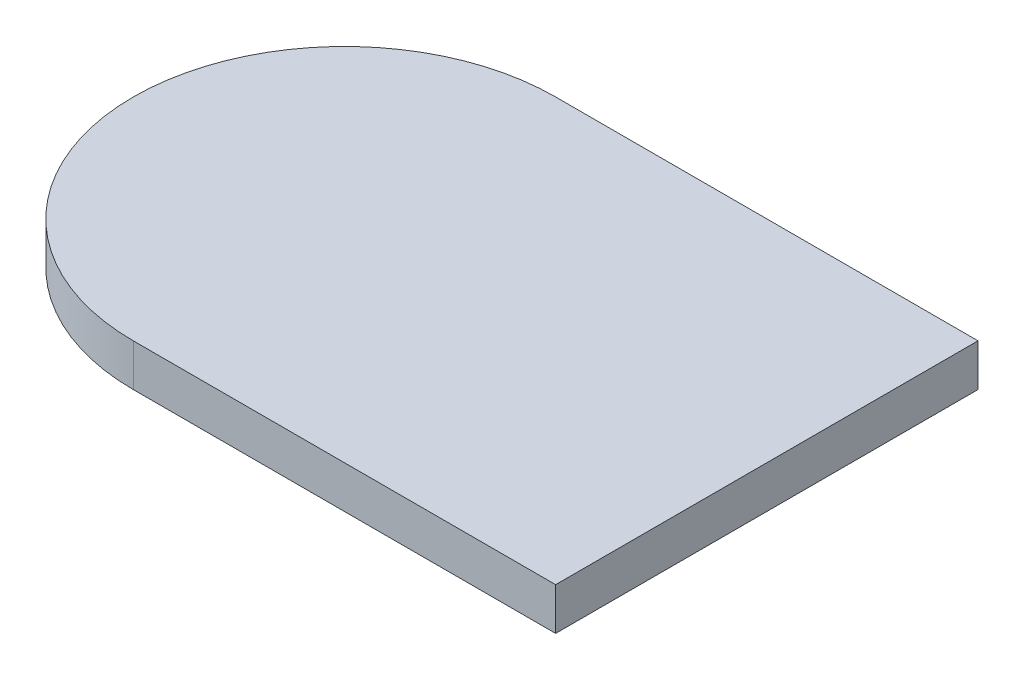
from build123d import *

# Parameters (mm, degrees)
EXTRUDE1_DEPTH = 5


with BuildPart() as part:
    # Sketch1 → Extrude1 (new body)
    with BuildSketch(Plane(origin=(0, 0, 0), x_dir=(1, 0, 0), z_dir=(0, 1, 0))):
        with BuildLine():
            Line((0, 0), (-50, 0))
            ThreePointArc((-50, 0), (-75, 25), (-50, 50))
            Line((-50, 50), (0, 50))
            Line((0, 50), (0, 0))
        make_face()
    extrude(amount=EXTRUDE1_DEPTH)


solid = part.part
